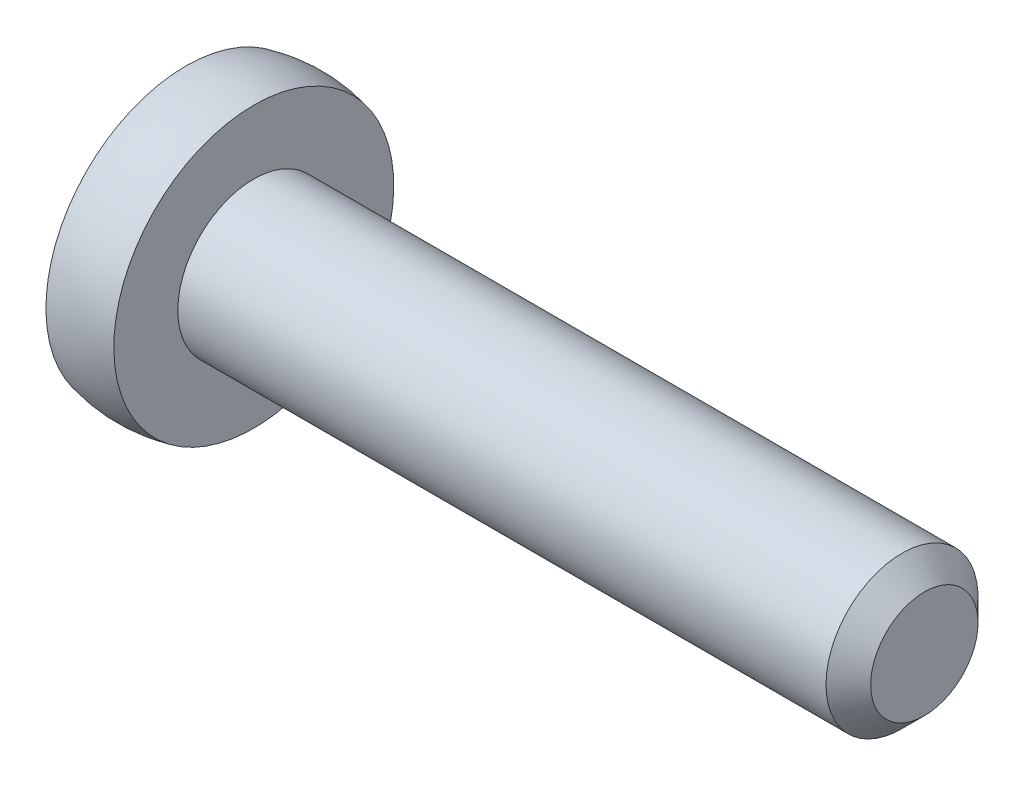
ISO-10303-21;
HEADER;
FILE_DESCRIPTION(('STEP AP214'),'2;1');
FILE_NAME('part.step','',(''),(''),'','','');
FILE_SCHEMA(('AUTOMOTIVE_DESIGN { 1 0 10303 214 1 1 1 1 }'));
ENDSEC;
DATA;
#1=APPLICATION_CONTEXT('core data for automotive mechanical design processes');
#2=APPLICATION_PROTOCOL_DEFINITION('international standard','automotive_design',2000,#1);
#3=PRODUCT_CONTEXT('',#1,'mechanical');
#4=PRODUCT('Part','Part','',(#3));
#5=PRODUCT_RELATED_PRODUCT_CATEGORY('part','',(#4));
#6=PRODUCT_DEFINITION_FORMATION('','',#4);
#7=PRODUCT_DEFINITION_CONTEXT('part definition',#1,'design');
#8=PRODUCT_DEFINITION('design','',#6,#7);
#9=PRODUCT_DEFINITION_SHAPE('','',#8);
#10=(LENGTH_UNIT() NAMED_UNIT(*) SI_UNIT(.MILLI.,.METRE.));
#11=(NAMED_UNIT(*) PLANE_ANGLE_UNIT() SI_UNIT($,.RADIAN.));
#12=(NAMED_UNIT(*) SI_UNIT($,.STERADIAN.) SOLID_ANGLE_UNIT());
#13=UNCERTAINTY_MEASURE_WITH_UNIT(LENGTH_MEASURE(1.E-05),#10,'distance_accuracy_value','');
#14=(GEOMETRIC_REPRESENTATION_CONTEXT(3) GLOBAL_UNCERTAINTY_ASSIGNED_CONTEXT((#13)) GLOBAL_UNIT_ASSIGNED_CONTEXT((#10,
#11,#12)) REPRESENTATION_CONTEXT('',''));
#15=CARTESIAN_POINT('',(0.,0.,0.));
#16=DIRECTION('',(0.,0.,1.));
#17=DIRECTION('',(1.,0.,0.));
#18=AXIS2_PLACEMENT_3D('',#15,#16,#17);
#19=CARTESIAN_POINT('',(2.20574710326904,0.,0.));
#20=DIRECTION('',(1.,0.,0.));
#21=DIRECTION('',(0.,0.,-1.));
#22=AXIS2_PLACEMENT_3D('',#19,#20,#21);
#23=PLANE('',#22);
#24=CARTESIAN_POINT('',(2.20574710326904,0.,0.));
#25=DIRECTION('',(1.,0.,0.));
#26=DIRECTION('',(0.,0.,-1.));
#27=AXIS2_PLACEMENT_3D('',#24,#25,#26);
#28=CIRCLE('',#27,3.97587531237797);
#29=CARTESIAN_POINT('',(2.20574710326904,3.97587531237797,0.));
#30=VERTEX_POINT('',#29);
#31=EDGE_CURVE('E147',#30,#30,#28,.T.);
#32=ORIENTED_EDGE('',*,*,#31,.T.);
#33=EDGE_LOOP('',(#32));
#34=FACE_BOUND('',#33,.T.);
#35=CARTESIAN_POINT('',(2.20574710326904,0.,0.));
#36=DIRECTION('',(1.,0.,0.));
#37=DIRECTION('',(0.,0.,-1.));
#38=AXIS2_PLACEMENT_3D('',#35,#36,#37);
#39=CIRCLE('',#38,2.159);
#40=CARTESIAN_POINT('',(2.20574710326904,0.,2.159));
#41=VERTEX_POINT('',#40);
#42=EDGE_CURVE('E140',#41,#41,#39,.T.);
#43=ORIENTED_EDGE('',*,*,#42,.F.);
#44=EDGE_LOOP('',(#43));
#45=FACE_BOUND('',#44,.T.);
#46=ADVANCED_FACE('F36',(#34,#45),#23,.T.);
#47=CARTESIAN_POINT('',(6.77774710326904,0.,0.));
#48=DIRECTION('',(1.,0.,0.));
#49=DIRECTION('',(0.,1.,0.));
#50=AXIS2_PLACEMENT_3D('',#47,#48,#49);
#51=SPHERICAL_SURFACE('',#50,7.62);
#52=CARTESIAN_POINT('',(0.277222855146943,0.,0.));
#53=DIRECTION('',(1.,0.,0.));
#54=DIRECTION('',(0.,0.,-1.));
#55=AXIS2_PLACEMENT_3D('',#52,#53,#54);
#56=CIRCLE('',#55,3.97587531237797);
#57=CARTESIAN_POINT('',(0.277222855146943,3.97587531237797,0.));
#58=VERTEX_POINT('',#57);
#59=EDGE_CURVE('E143',#58,#58,#56,.T.);
#60=ORIENTED_EDGE('',*,*,#59,.F.);
#61=EDGE_LOOP('',(#60));
#62=FACE_BOUND('',#61,.T.);
#63=CARTESIAN_POINT('',(6.58914186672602,-0.97028982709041,0.));
#64=DIRECTION('',(0.190808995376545,0.981627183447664,0.));
#65=DIRECTION('',(-0.981627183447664,0.190808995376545,0.));
#66=AXIS2_PLACEMENT_3D('',#63,#64,#65);
#67=CIRCLE('',#66,7.55561815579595);
#68=CARTESIAN_POINT('',(-0.813379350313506,0.468614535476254,0.468614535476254));
#69=VERTEX_POINT('',#68);
#70=CARTESIAN_POINT('',(-0.434610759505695,0.394989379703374,2.42698937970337));
#71=VERTEX_POINT('',#70);
#72=EDGE_CURVE('E201',#69,#71,#67,.T.);
#73=ORIENTED_EDGE('',*,*,#72,.T.);
#74=CARTESIAN_POINT('',(6.96974216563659,0.,0.987728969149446));
#75=DIRECTION('',(0.190808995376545,0.,0.981627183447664));
#76=DIRECTION('',(0.981627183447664,0.,-0.190808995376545));
#77=AXIS2_PLACEMENT_3D('',#74,#75,#76);
#78=CIRCLE('',#77,7.55327275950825);
#79=CARTESIAN_POINT('',(-0.434610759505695,-0.394989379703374,2.42698937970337));
#80=VERTEX_POINT('',#79);
#81=EDGE_CURVE('E232',#71,#80,#78,.T.);
#82=ORIENTED_EDGE('',*,*,#81,.T.);
#83=CARTESIAN_POINT('',(6.58914186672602,0.97028982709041,0.));
#84=DIRECTION('',(0.190808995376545,-0.981627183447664,0.));
#85=DIRECTION('',(0.981627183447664,0.190808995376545,0.));
#86=AXIS2_PLACEMENT_3D('',#83,#84,#85);
#87=CIRCLE('',#86,7.55561815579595);
#88=CARTESIAN_POINT('',(-0.813379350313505,-0.468614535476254,0.468614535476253));
#89=VERTEX_POINT('',#88);
#90=EDGE_CURVE('E59',#80,#89,#87,.T.);
#91=ORIENTED_EDGE('',*,*,#90,.T.);
#92=CARTESIAN_POINT('',(6.58914186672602,0.,-0.970289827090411));
#93=DIRECTION('',(0.190808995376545,0.,0.981627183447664));
#94=DIRECTION('',(0.981627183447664,0.,-0.190808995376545));
#95=AXIS2_PLACEMENT_3D('',#92,#93,#94);
#96=CIRCLE('',#95,7.55561815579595);
#97=CARTESIAN_POINT('',(-0.434610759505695,-2.42698937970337,0.394989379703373));
#98=VERTEX_POINT('',#97);
#99=EDGE_CURVE('E228',#89,#98,#96,.T.);
#100=ORIENTED_EDGE('',*,*,#99,.T.);
#101=CARTESIAN_POINT('',(6.96974216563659,-0.987728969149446,0.));
#102=DIRECTION('',(0.190808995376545,-0.981627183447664,0.));
#103=DIRECTION('',(0.981627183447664,0.190808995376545,0.));
#104=AXIS2_PLACEMENT_3D('',#101,#102,#103);
#105=CIRCLE('',#104,7.55327275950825);
#106=CARTESIAN_POINT('',(-0.434610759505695,-2.42698937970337,-0.394989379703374));
#107=VERTEX_POINT('',#106);
#108=EDGE_CURVE('E225',#98,#107,#105,.T.);
#109=ORIENTED_EDGE('',*,*,#108,.T.);
#110=CARTESIAN_POINT('',(6.58914186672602,0.,0.97028982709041));
#111=DIRECTION('',(0.190808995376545,0.,-0.981627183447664));
#112=DIRECTION('',(-0.981627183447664,0.,-0.190808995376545));
#113=AXIS2_PLACEMENT_3D('',#110,#111,#112);
#114=CIRCLE('',#113,7.55561815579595);
#115=CARTESIAN_POINT('',(-0.813379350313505,-0.468614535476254,-0.468614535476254));
#116=VERTEX_POINT('',#115);
#117=EDGE_CURVE('E222',#107,#116,#114,.T.);
#118=ORIENTED_EDGE('',*,*,#117,.T.);
#119=CARTESIAN_POINT('',(6.58914186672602,0.97028982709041,0.));
#120=DIRECTION('',(0.190808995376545,-0.981627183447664,0.));
#121=DIRECTION('',(0.981627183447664,0.190808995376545,0.));
#122=AXIS2_PLACEMENT_3D('',#119,#120,#121);
#123=CIRCLE('',#122,7.55561815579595);
#124=CARTESIAN_POINT('',(-0.434610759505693,-0.394989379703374,-2.42698937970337));
#125=VERTEX_POINT('',#124);
#126=EDGE_CURVE('E219',#116,#125,#123,.T.);
#127=ORIENTED_EDGE('',*,*,#126,.T.);
#128=CARTESIAN_POINT('',(6.96974216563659,0.,-0.987728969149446));
#129=DIRECTION('',(0.190808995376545,0.,-0.981627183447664));
#130=DIRECTION('',(-0.981627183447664,0.,-0.190808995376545));
#131=AXIS2_PLACEMENT_3D('',#128,#129,#130);
#132=CIRCLE('',#131,7.55327275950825);
#133=CARTESIAN_POINT('',(-0.434610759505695,0.394989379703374,-2.42698937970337));
#134=VERTEX_POINT('',#133);
#135=EDGE_CURVE('E216',#125,#134,#132,.T.);
#136=ORIENTED_EDGE('',*,*,#135,.T.);
#137=CARTESIAN_POINT('',(6.58914186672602,-0.97028982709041,0.));
#138=DIRECTION('',(0.190808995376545,0.981627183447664,0.));
#139=DIRECTION('',(-0.981627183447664,0.190808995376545,0.));
#140=AXIS2_PLACEMENT_3D('',#137,#138,#139);
#141=CIRCLE('',#140,7.55561815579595);
#142=CARTESIAN_POINT('',(-0.813379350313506,0.468614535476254,-0.468614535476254));
#143=VERTEX_POINT('',#142);
#144=EDGE_CURVE('E213',#134,#143,#141,.T.);
#145=ORIENTED_EDGE('',*,*,#144,.T.);
#146=CARTESIAN_POINT('',(6.58914186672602,0.,0.97028982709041));
#147=DIRECTION('',(0.190808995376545,0.,-0.981627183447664));
#148=DIRECTION('',(-0.981627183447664,0.,-0.190808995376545));
#149=AXIS2_PLACEMENT_3D('',#146,#147,#148);
#150=CIRCLE('',#149,7.55561815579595);
#151=CARTESIAN_POINT('',(-0.434610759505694,2.42698937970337,-0.394989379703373));
#152=VERTEX_POINT('',#151);
#153=EDGE_CURVE('E210',#143,#152,#150,.T.);
#154=ORIENTED_EDGE('',*,*,#153,.T.);
#155=CARTESIAN_POINT('',(6.96974216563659,0.987728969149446,0.));
#156=DIRECTION('',(0.190808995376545,0.981627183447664,0.));
#157=DIRECTION('',(-0.981627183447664,0.190808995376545,0.));
#158=AXIS2_PLACEMENT_3D('',#155,#156,#157);
#159=CIRCLE('',#158,7.55327275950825);
#160=CARTESIAN_POINT('',(-0.434610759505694,2.42698937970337,0.394989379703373));
#161=VERTEX_POINT('',#160);
#162=EDGE_CURVE('E207',#152,#161,#159,.T.);
#163=ORIENTED_EDGE('',*,*,#162,.T.);
#164=CARTESIAN_POINT('',(6.58914186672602,0.,-0.97028982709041));
#165=DIRECTION('',(0.190808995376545,0.,0.981627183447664));
#166=DIRECTION('',(0.981627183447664,0.,-0.190808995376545));
#167=AXIS2_PLACEMENT_3D('',#164,#165,#166);
#168=CIRCLE('',#167,7.55561815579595);
#169=EDGE_CURVE('E204',#161,#69,#168,.T.);
#170=ORIENTED_EDGE('',*,*,#169,.T.);
#171=EDGE_LOOP('',(#73,#82,#91,#100,#109,#118,#127,#136,#145,#154,#163,#170));
#172=FACE_BOUND('',#171,.T.);
#173=ADVANCED_FACE('F247',(#62,#172),#51,.T.);
#174=CARTESIAN_POINT('',(1.24148497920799,0.,0.));
#175=DIRECTION('',(1.,0.,0.));
#176=DIRECTION('',(0.,1.,0.));
#177=AXIS2_PLACEMENT_3D('',#174,#175,#176);
#178=SPHERICAL_SURFACE('',#177,4.09113504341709);
#179=CARTESIAN_POINT('',(0.277222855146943,3.97587531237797,0.));
#180=CARTESIAN_POINT('',(0.296931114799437,3.98065513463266,0.));
#181=CARTESIAN_POINT('',(0.31667491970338,3.98528839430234,0.));
#182=CARTESIAN_POINT('',(0.356229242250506,3.9942608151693,0.));
#183=CARTESIAN_POINT('',(0.376039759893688,3.99859997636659,0.));
#184=CARTESIAN_POINT('',(0.415723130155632,4.00698322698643,0.));
#185=CARTESIAN_POINT('',(0.435595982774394,4.01102731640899,0.));
#186=CARTESIAN_POINT('',(0.475399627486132,4.01881953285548,0.));
#187=CARTESIAN_POINT('',(0.495330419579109,4.02256765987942,0.));
#188=CARTESIAN_POINT('',(0.535245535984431,4.02976712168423,0.));
#189=CARTESIAN_POINT('',(0.555229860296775,4.0332184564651,0.));
#190=CARTESIAN_POINT('',(0.5952476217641,4.0398235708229,0.));
#191=CARTESIAN_POINT('',(0.615281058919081,4.04297735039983,0.));
#192=CARTESIAN_POINT('',(0.655392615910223,4.04898665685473,0.));
#193=CARTESIAN_POINT('',(0.675470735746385,4.05184218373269,0.));
#194=CARTESIAN_POINT('',(0.715667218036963,4.05725435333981,0.));
#195=CARTESIAN_POINT('',(0.735785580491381,4.05981099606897,0.));
#196=CARTESIAN_POINT('',(0.77605809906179,4.06462483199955,0.));
#197=CARTESIAN_POINT('',(0.796212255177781,4.06688202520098,0.));
#198=CARTESIAN_POINT('',(0.836551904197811,4.07109646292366,0.));
#199=CARTESIAN_POINT('',(0.856737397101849,4.07305370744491,0.));
#200=CARTESIAN_POINT('',(0.897135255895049,4.07666781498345,0.));
#201=CARTESIAN_POINT('',(0.917347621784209,4.07832467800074,0.));
#202=CARTESIAN_POINT('',(0.957794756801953,4.08133765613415,0.));
#203=CARTESIAN_POINT('',(0.978029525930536,4.08269377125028,0.));
#204=CARTESIAN_POINT('',(1.01851699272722,4.08510495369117,0.));
#205=CARTESIAN_POINT('',(1.03876969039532,4.08616002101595,0.));
#206=CARTESIAN_POINT('',(1.07928853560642,4.08796887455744,0.));
#207=CARTESIAN_POINT('',(1.09955468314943,4.08872266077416,0.));
#208=CARTESIAN_POINT('',(1.14009594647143,4.08992878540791,0.));
#209=CARTESIAN_POINT('',(1.16037106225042,4.09038112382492,0.));
#210=CARTESIAN_POINT('',(1.20092577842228,4.09098425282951,0.));
#211=CARTESIAN_POINT('',(1.22120537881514,4.09113504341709,0.));
#212=CARTESIAN_POINT('',(1.26176457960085,4.09113504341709,0.));
#213=CARTESIAN_POINT('',(1.28204417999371,4.09098425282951,0.));
#214=CARTESIAN_POINT('',(1.32259889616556,4.09038112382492,0.));
#215=CARTESIAN_POINT('',(1.34287401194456,4.08992878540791,0.));
#216=CARTESIAN_POINT('',(1.38341527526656,4.08872266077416,0.));
#217=CARTESIAN_POINT('',(1.40368142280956,4.08796887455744,0.));
#218=CARTESIAN_POINT('',(1.44420026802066,4.08616002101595,0.));
#219=CARTESIAN_POINT('',(1.46445296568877,4.08510495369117,0.));
#220=CARTESIAN_POINT('',(1.50494043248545,4.08269377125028,0.));
#221=CARTESIAN_POINT('',(1.52517520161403,4.08133765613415,0.));
#222=CARTESIAN_POINT('',(1.56562233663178,4.07832467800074,0.));
#223=CARTESIAN_POINT('',(1.58583470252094,4.07666781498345,0.));
#224=CARTESIAN_POINT('',(1.62623256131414,4.07305370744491,0.));
#225=CARTESIAN_POINT('',(1.64641805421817,4.07109646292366,0.));
#226=CARTESIAN_POINT('',(1.6867577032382,4.06688202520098,0.));
#227=CARTESIAN_POINT('',(1.70691185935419,4.06462483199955,0.));
#228=CARTESIAN_POINT('',(1.7471843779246,4.05981099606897,0.));
#229=CARTESIAN_POINT('',(1.76730274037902,4.05725435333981,0.));
#230=CARTESIAN_POINT('',(1.8074992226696,4.05184218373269,0.));
#231=CARTESIAN_POINT('',(1.82757734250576,4.04898665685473,0.));
#232=CARTESIAN_POINT('',(1.8676888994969,4.04297735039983,0.));
#233=CARTESIAN_POINT('',(1.88772233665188,4.0398235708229,0.));
#234=CARTESIAN_POINT('',(1.92774009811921,4.0332184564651,0.));
#235=CARTESIAN_POINT('',(1.94772442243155,4.02976712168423,0.));
#236=CARTESIAN_POINT('',(1.98763953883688,4.02256765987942,0.));
#237=CARTESIAN_POINT('',(2.00757033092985,4.01881953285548,0.));
#238=CARTESIAN_POINT('',(2.04737397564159,4.01102731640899,0.));
#239=CARTESIAN_POINT('',(2.06724682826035,4.00698322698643,0.));
#240=CARTESIAN_POINT('',(2.1069301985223,3.99859997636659,0.));
#241=CARTESIAN_POINT('',(2.12674071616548,3.9942608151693,0.));
#242=CARTESIAN_POINT('',(2.1662950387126,3.98528839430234,0.));
#243=CARTESIAN_POINT('',(2.18603884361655,3.98065513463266,0.));
#244=CARTESIAN_POINT('',(2.20574710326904,3.97587531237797,0.));
#245=B_SPLINE_CURVE_WITH_KNOTS('',3,(#179,#180,#181,#182,#183,#184,#185,#186,#187,#188,#189,
#190,#191,#192,#193,#194,#195,#196,#197,#198,#199,#200,#201,#202,#203,#204,#205,#206,#207,#208,
#209,#210,#211,#212,#213,#214,#215,#216,#217,#218,#219,#220,#221,#222,#223,#224,#225,#226,#227,
#228,#229,#230,#231,#232,#233,#234,#235,#236,#237,#238,#239,#240,#241,#242,#243,#244),
.UNSPECIFIED.,.F.,.F.,(4,2,2,2,2,2,2,2,2,2,2,2,2,2,2,2,2,2,2,2,2,2,2,2,2,2,2,2,2,2,2,2,4),(0.,
0.0608382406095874,0.121676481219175,0.182514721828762,0.243352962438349,0.304191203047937,
0.365029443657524,0.425867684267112,0.486705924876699,0.547544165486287,0.608382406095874,
0.669220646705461,0.730058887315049,0.790897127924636,0.851735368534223,0.912573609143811,
0.973411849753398,1.03425009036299,1.09508833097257,1.15592657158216,1.21676481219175,
1.27760305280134,1.33844129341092,1.39927953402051,1.4601177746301,1.52095601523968,
1.58179425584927,1.64263249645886,1.70347073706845,1.76430897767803,1.82514721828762,
1.88598545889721,1.9468236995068),.UNSPECIFIED.);
#246=EDGE_CURVE('BSEAM253',#58,#30,#245,.T.);
#247=ORIENTED_EDGE('',*,*,#59,.T.);
#248=ORIENTED_EDGE('',*,*,#31,.F.);
#249=ORIENTED_EDGE('',*,*,#246,.T.);
#250=ORIENTED_EDGE('',*,*,#246,.F.);
#251=EDGE_LOOP('',(#247,#249,#248,#250));
#252=FACE_BOUND('',#251,.T.);
#253=ADVANCED_FACE('F253',(#252),#178,.T.);
#254=CARTESIAN_POINT('',(-1.016,0.508,2.54));
#255=DIRECTION('',(0.190808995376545,0.,0.981627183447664));
#256=DIRECTION('',(0.981627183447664,0.,-0.190808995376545));
#257=AXIS2_PLACEMENT_3D('',#254,#255,#256);
#258=PLANE('',#257);
#259=DIRECTION('',(-0.964231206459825,0.187427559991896,0.187427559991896));
#260=VECTOR('',#259,1.);
#261=CARTESIAN_POINT('',(-1.016,0.508,2.54));
#262=LINE('',#261,#260);
#263=CARTESIAN_POINT('',(0.889,0.137705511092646,2.16970551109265));
#264=VERTEX_POINT('',#263);
#265=EDGE_CURVE('E51',#264,#71,#262,.T.);
#266=ORIENTED_EDGE('',*,*,#265,.F.);
#267=DIRECTION('',(0.,1.,0.));
#268=VECTOR('',#267,1.);
#269=CARTESIAN_POINT('',(0.889,-0.508,2.16970551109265));
#270=LINE('',#269,#268);
#271=CARTESIAN_POINT('',(0.889,-0.137705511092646,2.16970551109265));
#272=VERTEX_POINT('',#271);
#273=EDGE_CURVE('E131',#264,#272,#270,.F.);
#274=ORIENTED_EDGE('',*,*,#273,.T.);
#275=DIRECTION('',(-0.964231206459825,-0.187427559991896,0.187427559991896));
#276=VECTOR('',#275,1.);
#277=CARTESIAN_POINT('',(-0.648769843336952,-0.436617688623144,2.46861768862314));
#278=LINE('',#277,#276);
#279=EDGE_CURVE('E138',#272,#80,#278,.T.);
#280=ORIENTED_EDGE('',*,*,#279,.T.);
#281=ORIENTED_EDGE('',*,*,#81,.F.);
#282=EDGE_LOOP('',(#266,#274,#280,#281));
#283=FACE_BOUND('',#282,.T.);
#284=ADVANCED_FACE('F137',(#283),#258,.F.);
#285=CARTESIAN_POINT('',(-1.016,-0.508,0.507999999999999));
#286=DIRECTION('',(0.190808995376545,-0.981627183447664,0.));
#287=DIRECTION('',(0.981627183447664,0.190808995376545,0.));
#288=AXIS2_PLACEMENT_3D('',#285,#286,#287);
#289=PLANE('',#288);
#290=ORIENTED_EDGE('',*,*,#279,.F.);
#291=DIRECTION('',(0.,0.,1.));
#292=VECTOR('',#291,1.);
#293=CARTESIAN_POINT('',(0.889,-0.137705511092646,2.54));
#294=LINE('',#293,#292);
#295=CARTESIAN_POINT('',(0.889,-0.137705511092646,0.137705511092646));
#296=VERTEX_POINT('',#295);
#297=EDGE_CURVE('E127',#272,#296,#294,.F.);
#298=ORIENTED_EDGE('',*,*,#297,.T.);
#299=DIRECTION('',(-0.964231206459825,-0.187427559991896,0.187427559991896));
#300=VECTOR('',#299,1.);
#301=CARTESIAN_POINT('',(-1.016,-0.508,0.507999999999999));
#302=LINE('',#301,#300);
#303=EDGE_CURVE('E144',#296,#89,#302,.T.);
#304=ORIENTED_EDGE('',*,*,#303,.T.);
#305=ORIENTED_EDGE('',*,*,#90,.F.);
#306=EDGE_LOOP('',(#290,#298,#304,#305));
#307=FACE_BOUND('',#306,.T.);
#308=ADVANCED_FACE('F142',(#307),#289,.F.);
#309=CARTESIAN_POINT('',(-1.016,-2.54,0.507999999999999));
#310=DIRECTION('',(0.190808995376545,0.,0.981627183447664));
#311=DIRECTION('',(0.981627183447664,0.,-0.190808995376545));
#312=AXIS2_PLACEMENT_3D('',#309,#310,#311);
#313=PLANE('',#312);
#314=ORIENTED_EDGE('',*,*,#303,.F.);
#315=DIRECTION('',(0.,1.,0.));
#316=VECTOR('',#315,1.);
#317=CARTESIAN_POINT('',(0.889,-0.508,0.137705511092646));
#318=LINE('',#317,#316);
#319=CARTESIAN_POINT('',(0.889,-2.16970551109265,0.137705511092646));
#320=VERTEX_POINT('',#319);
#321=EDGE_CURVE('E133',#296,#320,#318,.F.);
#322=ORIENTED_EDGE('',*,*,#321,.T.);
#323=DIRECTION('',(-0.964231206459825,-0.187427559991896,0.187427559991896));
#324=VECTOR('',#323,1.);
#325=CARTESIAN_POINT('',(-1.016,-2.54,0.507999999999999));
#326=LINE('',#325,#324);
#327=EDGE_CURVE('E149',#320,#98,#326,.T.);
#328=ORIENTED_EDGE('',*,*,#327,.T.);
#329=ORIENTED_EDGE('',*,*,#99,.F.);
#330=EDGE_LOOP('',(#314,#322,#328,#329));
#331=FACE_BOUND('',#330,.T.);
#332=ADVANCED_FACE('F302',(#331),#313,.F.);
#333=CARTESIAN_POINT('',(-1.016,-2.54,0.507999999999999));
#334=DIRECTION('',(0.190808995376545,-0.981627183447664,0.));
#335=DIRECTION('',(0.981627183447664,0.190808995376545,0.));
#336=AXIS2_PLACEMENT_3D('',#333,#334,#335);
#337=PLANE('',#336);
#338=ORIENTED_EDGE('',*,*,#327,.F.);
#339=DIRECTION('',(0.,0.,1.));
#340=VECTOR('',#339,1.);
#341=CARTESIAN_POINT('',(0.889,-2.16970551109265,2.54));
#342=LINE('',#341,#340);
#343=CARTESIAN_POINT('',(0.889,-2.16970551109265,-0.137705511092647));
#344=VERTEX_POINT('',#343);
#345=EDGE_CURVE('E182',#320,#344,#342,.F.);
#346=ORIENTED_EDGE('',*,*,#345,.T.);
#347=DIRECTION('',(-0.964231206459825,-0.187427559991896,-0.187427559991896));
#348=VECTOR('',#347,1.);
#349=CARTESIAN_POINT('',(-0.648769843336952,-2.46861768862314,-0.436617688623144));
#350=LINE('',#349,#348);
#351=EDGE_CURVE('E176',#344,#107,#350,.T.);
#352=ORIENTED_EDGE('',*,*,#351,.T.);
#353=ORIENTED_EDGE('',*,*,#108,.F.);
#354=EDGE_LOOP('',(#338,#346,#352,#353));
#355=FACE_BOUND('',#354,.T.);
#356=ADVANCED_FACE('F300',(#355),#337,.F.);
#357=CARTESIAN_POINT('',(-1.016,-0.508,-0.508));
#358=DIRECTION('',(0.190808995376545,0.,-0.981627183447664));
#359=DIRECTION('',(-0.981627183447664,0.,-0.190808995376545));
#360=AXIS2_PLACEMENT_3D('',#357,#358,#359);
#361=PLANE('',#360);
#362=ORIENTED_EDGE('',*,*,#351,.F.);
#363=DIRECTION('',(0.,-1.,0.));
#364=VECTOR('',#363,1.);
#365=CARTESIAN_POINT('',(0.889,-0.508,-0.137705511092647));
#366=LINE('',#365,#364);
#367=CARTESIAN_POINT('',(0.889,-0.137705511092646,-0.137705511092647));
#368=VERTEX_POINT('',#367);
#369=EDGE_CURVE('E184',#344,#368,#366,.F.);
#370=ORIENTED_EDGE('',*,*,#369,.T.);
#371=DIRECTION('',(-0.964231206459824,-0.187427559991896,-0.187427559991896));
#372=VECTOR('',#371,1.);
#373=CARTESIAN_POINT('',(-1.016,-0.508,-0.508));
#374=LINE('',#373,#372);
#375=EDGE_CURVE('E173',#368,#116,#374,.T.);
#376=ORIENTED_EDGE('',*,*,#375,.T.);
#377=ORIENTED_EDGE('',*,*,#117,.F.);
#378=EDGE_LOOP('',(#362,#370,#376,#377));
#379=FACE_BOUND('',#378,.T.);
#380=ADVANCED_FACE('F297',(#379),#361,.F.);
#381=CARTESIAN_POINT('',(-1.016,-0.508,-2.54));
#382=DIRECTION('',(0.190808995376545,-0.981627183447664,0.));
#383=DIRECTION('',(0.981627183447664,0.190808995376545,0.));
#384=AXIS2_PLACEMENT_3D('',#381,#382,#383);
#385=PLANE('',#384);
#386=ORIENTED_EDGE('',*,*,#375,.F.);
#387=DIRECTION('',(0.,0.,1.));
#388=VECTOR('',#387,1.);
#389=CARTESIAN_POINT('',(0.889,-0.137705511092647,2.54));
#390=LINE('',#389,#388);
#391=CARTESIAN_POINT('',(0.889,-0.137705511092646,-2.16970551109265));
#392=VERTEX_POINT('',#391);
#393=EDGE_CURVE('E186',#368,#392,#390,.F.);
#394=ORIENTED_EDGE('',*,*,#393,.T.);
#395=DIRECTION('',(-0.964231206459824,-0.187427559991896,-0.187427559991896));
#396=VECTOR('',#395,1.);
#397=CARTESIAN_POINT('',(-0.832384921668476,-0.472308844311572,-2.50430884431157));
#398=LINE('',#397,#396);
#399=EDGE_CURVE('E170',#392,#125,#398,.T.);
#400=ORIENTED_EDGE('',*,*,#399,.T.);
#401=ORIENTED_EDGE('',*,*,#126,.F.);
#402=EDGE_LOOP('',(#386,#394,#400,#401));
#403=FACE_BOUND('',#402,.T.);
#404=ADVANCED_FACE('F294',(#403),#385,.F.);
#405=CARTESIAN_POINT('',(-1.016,0.508,-2.54));
#406=DIRECTION('',(0.190808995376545,0.,-0.981627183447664));
#407=DIRECTION('',(-0.981627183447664,0.,-0.190808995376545));
#408=AXIS2_PLACEMENT_3D('',#405,#406,#407);
#409=PLANE('',#408);
#410=ORIENTED_EDGE('',*,*,#399,.F.);
#411=DIRECTION('',(0.,-1.,0.));
#412=VECTOR('',#411,1.);
#413=CARTESIAN_POINT('',(0.889,-0.508,-2.16970551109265));
#414=LINE('',#413,#412);
#415=CARTESIAN_POINT('',(0.889,0.137705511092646,-2.16970551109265));
#416=VERTEX_POINT('',#415);
#417=EDGE_CURVE('E188',#392,#416,#414,.F.);
#418=ORIENTED_EDGE('',*,*,#417,.T.);
#419=DIRECTION('',(-0.964231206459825,0.187427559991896,-0.187427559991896));
#420=VECTOR('',#419,1.);
#421=CARTESIAN_POINT('',(-0.648769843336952,0.436617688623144,-2.46861768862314));
#422=LINE('',#421,#420);
#423=EDGE_CURVE('E167',#416,#134,#422,.T.);
#424=ORIENTED_EDGE('',*,*,#423,.T.);
#425=ORIENTED_EDGE('',*,*,#135,.F.);
#426=EDGE_LOOP('',(#410,#418,#424,#425));
#427=FACE_BOUND('',#426,.T.);
#428=ADVANCED_FACE('F288',(#427),#409,.F.);
#429=CARTESIAN_POINT('',(-1.016,0.508,-0.508));
#430=DIRECTION('',(0.190808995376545,0.981627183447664,0.));
#431=DIRECTION('',(-0.981627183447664,0.190808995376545,0.));
#432=AXIS2_PLACEMENT_3D('',#429,#430,#431);
#433=PLANE('',#432);
#434=ORIENTED_EDGE('',*,*,#423,.F.);
#435=DIRECTION('',(0.,0.,-1.));
#436=VECTOR('',#435,1.);
#437=CARTESIAN_POINT('',(0.889,0.137705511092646,2.54));
#438=LINE('',#437,#436);
#439=CARTESIAN_POINT('',(0.889,0.137705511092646,-0.137705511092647));
#440=VERTEX_POINT('',#439);
#441=EDGE_CURVE('E190',#416,#440,#438,.F.);
#442=ORIENTED_EDGE('',*,*,#441,.T.);
#443=DIRECTION('',(-0.964231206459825,0.187427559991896,-0.187427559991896));
#444=VECTOR('',#443,1.);
#445=CARTESIAN_POINT('',(-1.016,0.508,-0.508));
#446=LINE('',#445,#444);
#447=EDGE_CURVE('E164',#440,#143,#446,.T.);
#448=ORIENTED_EDGE('',*,*,#447,.T.);
#449=ORIENTED_EDGE('',*,*,#144,.F.);
#450=EDGE_LOOP('',(#434,#442,#448,#449));
#451=FACE_BOUND('',#450,.T.);
#452=ADVANCED_FACE('F285',(#451),#433,.F.);
#453=CARTESIAN_POINT('',(-1.016,2.54,-0.508));
#454=DIRECTION('',(0.190808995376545,0.,-0.981627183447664));
#455=DIRECTION('',(-0.981627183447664,0.,-0.190808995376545));
#456=AXIS2_PLACEMENT_3D('',#453,#454,#455);
#457=PLANE('',#456);
#458=ORIENTED_EDGE('',*,*,#447,.F.);
#459=DIRECTION('',(0.,-1.,0.));
#460=VECTOR('',#459,1.);
#461=CARTESIAN_POINT('',(0.889,-0.507999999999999,-0.137705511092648));
#462=LINE('',#461,#460);
#463=CARTESIAN_POINT('',(0.889,2.16970551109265,-0.137705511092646));
#464=VERTEX_POINT('',#463);
#465=EDGE_CURVE('E192',#440,#464,#462,.F.);
#466=ORIENTED_EDGE('',*,*,#465,.T.);
#467=DIRECTION('',(-0.964231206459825,0.187427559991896,-0.187427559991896));
#468=VECTOR('',#467,1.);
#469=CARTESIAN_POINT('',(-0.832384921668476,2.50430884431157,-0.472308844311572));
#470=LINE('',#469,#468);
#471=EDGE_CURVE('E161',#464,#152,#470,.T.);
#472=ORIENTED_EDGE('',*,*,#471,.T.);
#473=ORIENTED_EDGE('',*,*,#153,.F.);
#474=EDGE_LOOP('',(#458,#466,#472,#473));
#475=FACE_BOUND('',#474,.T.);
#476=ADVANCED_FACE('F282',(#475),#457,.F.);
#477=CARTESIAN_POINT('',(-1.016,2.54,0.508));
#478=DIRECTION('',(0.190808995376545,0.981627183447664,0.));
#479=DIRECTION('',(-0.981627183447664,0.190808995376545,0.));
#480=AXIS2_PLACEMENT_3D('',#477,#478,#479);
#481=PLANE('',#480);
#482=ORIENTED_EDGE('',*,*,#471,.F.);
#483=DIRECTION('',(0.,0.,-1.));
#484=VECTOR('',#483,1.);
#485=CARTESIAN_POINT('',(0.889,2.16970551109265,2.54));
#486=LINE('',#485,#484);
#487=CARTESIAN_POINT('',(0.889,2.16970551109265,0.137705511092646));
#488=VERTEX_POINT('',#487);
#489=EDGE_CURVE('E194',#464,#488,#486,.F.);
#490=ORIENTED_EDGE('',*,*,#489,.T.);
#491=DIRECTION('',(-0.964231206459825,0.187427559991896,0.187427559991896));
#492=VECTOR('',#491,1.);
#493=CARTESIAN_POINT('',(-0.648769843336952,2.46861768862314,0.436617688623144));
#494=LINE('',#493,#492);
#495=EDGE_CURVE('E158',#488,#161,#494,.T.);
#496=ORIENTED_EDGE('',*,*,#495,.T.);
#497=ORIENTED_EDGE('',*,*,#162,.F.);
#498=EDGE_LOOP('',(#482,#490,#496,#497));
#499=FACE_BOUND('',#498,.T.);
#500=ADVANCED_FACE('F279',(#499),#481,.F.);
#501=CARTESIAN_POINT('',(-1.016,0.508,0.508));
#502=DIRECTION('',(0.190808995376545,0.,0.981627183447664));
#503=DIRECTION('',(0.981627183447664,0.,-0.190808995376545));
#504=AXIS2_PLACEMENT_3D('',#501,#502,#503);
#505=PLANE('',#504);
#506=ORIENTED_EDGE('',*,*,#495,.F.);
#507=DIRECTION('',(0.,1.,0.));
#508=VECTOR('',#507,1.);
#509=CARTESIAN_POINT('',(0.889,-0.508,0.137705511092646));
#510=LINE('',#509,#508);
#511=CARTESIAN_POINT('',(0.889,0.137705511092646,0.137705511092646));
#512=VERTEX_POINT('',#511);
#513=EDGE_CURVE('E196',#488,#512,#510,.F.);
#514=ORIENTED_EDGE('',*,*,#513,.T.);
#515=DIRECTION('',(-0.964231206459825,0.187427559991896,0.187427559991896));
#516=VECTOR('',#515,1.);
#517=CARTESIAN_POINT('',(-1.016,0.508,0.508));
#518=LINE('',#517,#516);
#519=EDGE_CURVE('E154',#512,#69,#518,.T.);
#520=ORIENTED_EDGE('',*,*,#519,.T.);
#521=ORIENTED_EDGE('',*,*,#169,.F.);
#522=EDGE_LOOP('',(#506,#514,#520,#521));
#523=FACE_BOUND('',#522,.T.);
#524=ADVANCED_FACE('F272',(#523),#505,.F.);
#525=CARTESIAN_POINT('',(-1.016,0.508,2.54));
#526=DIRECTION('',(0.190808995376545,0.981627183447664,0.));
#527=DIRECTION('',(-0.981627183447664,0.190808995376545,0.));
#528=AXIS2_PLACEMENT_3D('',#525,#526,#527);
#529=PLANE('',#528);
#530=ORIENTED_EDGE('',*,*,#519,.F.);
#531=DIRECTION('',(0.,0.,-1.));
#532=VECTOR('',#531,1.);
#533=CARTESIAN_POINT('',(0.889,0.137705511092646,2.54));
#534=LINE('',#533,#532);
#535=EDGE_CURVE('E155',#512,#264,#534,.F.);
#536=ORIENTED_EDGE('',*,*,#535,.T.);
#537=ORIENTED_EDGE('',*,*,#265,.T.);
#538=ORIENTED_EDGE('',*,*,#72,.F.);
#539=EDGE_LOOP('',(#530,#536,#537,#538));
#540=FACE_BOUND('',#539,.T.);
#541=ADVANCED_FACE('F269',(#540),#529,.F.);
#542=CARTESIAN_POINT('',(0.889,-0.508,2.54));
#543=DIRECTION('',(-1.,0.,0.));
#544=DIRECTION('',(0.,0.,1.));
#545=AXIS2_PLACEMENT_3D('',#542,#543,#544);
#546=PLANE('',#545);
#547=ORIENTED_EDGE('',*,*,#273,.F.);
#548=ORIENTED_EDGE('',*,*,#535,.F.);
#549=ORIENTED_EDGE('',*,*,#513,.F.);
#550=ORIENTED_EDGE('',*,*,#489,.F.);
#551=ORIENTED_EDGE('',*,*,#465,.F.);
#552=ORIENTED_EDGE('',*,*,#441,.F.);
#553=ORIENTED_EDGE('',*,*,#417,.F.);
#554=ORIENTED_EDGE('',*,*,#393,.F.);
#555=ORIENTED_EDGE('',*,*,#369,.F.);
#556=ORIENTED_EDGE('',*,*,#345,.F.);
#557=ORIENTED_EDGE('',*,*,#321,.F.);
#558=ORIENTED_EDGE('',*,*,#297,.F.);
#559=EDGE_LOOP('',(#547,#548,#549,#550,#551,#552,#553,#554,#555,#556,#557,#558));
#560=FACE_BOUND('',#559,.T.);
#561=ADVANCED_FACE('F129',(#560),#546,.T.);
#562=CARTESIAN_POINT('',(21.255747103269,0.,0.));
#563=DIRECTION('',(-1.,0.,0.));
#564=DIRECTION('',(0.,0.,1.));
#565=AXIS2_PLACEMENT_3D('',#562,#563,#564);
#566=CYLINDRICAL_SURFACE('',#565,2.159);
#567=CARTESIAN_POINT('',(20.6207471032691,0.,0.));
#568=DIRECTION('',(1.,0.,0.));
#569=DIRECTION('',(0.,0.,-1.));
#570=AXIS2_PLACEMENT_3D('',#567,#568,#569);
#571=CIRCLE('',#570,2.159);
#572=CARTESIAN_POINT('',(20.620747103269,0.,2.159));
#573=VERTEX_POINT('',#572);
#574=EDGE_CURVE('E11',#573,#573,#571,.F.);
#575=CARTESIAN_POINT('',(20.620747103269,0.,2.159));
#576=CARTESIAN_POINT('',(20.4289241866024,0.,2.159));
#577=CARTESIAN_POINT('',(20.2371012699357,0.,2.159));
#578=CARTESIAN_POINT('',(19.8534554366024,0.,2.159));
#579=CARTESIAN_POINT('',(19.6616325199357,0.,2.159));
#580=CARTESIAN_POINT('',(19.2779866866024,0.,2.159));
#581=CARTESIAN_POINT('',(19.0861637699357,0.,2.159));
#582=CARTESIAN_POINT('',(18.7025179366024,0.,2.159));
#583=CARTESIAN_POINT('',(18.5106950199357,0.,2.159));
#584=CARTESIAN_POINT('',(18.1270491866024,0.,2.159));
#585=CARTESIAN_POINT('',(17.9352262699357,0.,2.159));
#586=CARTESIAN_POINT('',(17.5515804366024,0.,2.159));
#587=CARTESIAN_POINT('',(17.3597575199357,0.,2.159));
#588=CARTESIAN_POINT('',(16.9761116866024,0.,2.159));
#589=CARTESIAN_POINT('',(16.7842887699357,0.,2.159));
#590=CARTESIAN_POINT('',(16.4006429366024,0.,2.159));
#591=CARTESIAN_POINT('',(16.2088200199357,0.,2.159));
#592=CARTESIAN_POINT('',(15.8251741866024,0.,2.159));
#593=CARTESIAN_POINT('',(15.6333512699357,0.,2.159));
#594=CARTESIAN_POINT('',(15.2497054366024,0.,2.159));
#595=CARTESIAN_POINT('',(15.0578825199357,0.,2.159));
#596=CARTESIAN_POINT('',(14.6742366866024,0.,2.159));
#597=CARTESIAN_POINT('',(14.4824137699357,0.,2.159));
#598=CARTESIAN_POINT('',(14.0987679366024,0.,2.159));
#599=CARTESIAN_POINT('',(13.9069450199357,0.,2.159));
#600=CARTESIAN_POINT('',(13.5232991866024,0.,2.159));
#601=CARTESIAN_POINT('',(13.3314762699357,0.,2.159));
#602=CARTESIAN_POINT('',(12.9478304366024,0.,2.159));
#603=CARTESIAN_POINT('',(12.7560075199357,0.,2.159));
#604=CARTESIAN_POINT('',(12.3723616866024,0.,2.159));
#605=CARTESIAN_POINT('',(12.1805387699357,0.,2.159));
#606=CARTESIAN_POINT('',(11.7968929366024,0.,2.159));
#607=CARTESIAN_POINT('',(11.6050700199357,0.,2.159));
#608=CARTESIAN_POINT('',(11.2214241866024,0.,2.159));
#609=CARTESIAN_POINT('',(11.0296012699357,0.,2.159));
#610=CARTESIAN_POINT('',(10.6459554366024,0.,2.159));
#611=CARTESIAN_POINT('',(10.4541325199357,0.,2.159));
#612=CARTESIAN_POINT('',(10.0704866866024,0.,2.159));
#613=CARTESIAN_POINT('',(9.87866376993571,0.,2.159));
#614=CARTESIAN_POINT('',(9.49501793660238,0.,2.159));
#615=CARTESIAN_POINT('',(9.30319501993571,0.,2.159));
#616=CARTESIAN_POINT('',(8.91954918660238,0.,2.159));
#617=CARTESIAN_POINT('',(8.72772626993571,0.,2.159));
#618=CARTESIAN_POINT('',(8.34408043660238,0.,2.159));
#619=CARTESIAN_POINT('',(8.15225751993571,0.,2.159));
#620=CARTESIAN_POINT('',(7.76861168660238,0.,2.159));
#621=CARTESIAN_POINT('',(7.57678876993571,0.,2.159));
#622=CARTESIAN_POINT('',(7.19314293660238,0.,2.159));
#623=CARTESIAN_POINT('',(7.00132001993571,0.,2.159));
#624=CARTESIAN_POINT('',(6.61767418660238,0.,2.159));
#625=CARTESIAN_POINT('',(6.42585126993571,0.,2.159));
#626=CARTESIAN_POINT('',(6.04220543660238,0.,2.159));
#627=CARTESIAN_POINT('',(5.85038251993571,0.,2.159));
#628=CARTESIAN_POINT('',(5.46673668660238,0.,2.159));
#629=CARTESIAN_POINT('',(5.27491376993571,0.,2.159));
#630=CARTESIAN_POINT('',(4.89126793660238,0.,2.159));
#631=CARTESIAN_POINT('',(4.69944501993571,0.,2.159));
#632=CARTESIAN_POINT('',(4.31579918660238,0.,2.159));
#633=CARTESIAN_POINT('',(4.12397626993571,0.,2.159));
#634=CARTESIAN_POINT('',(3.74033043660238,0.,2.159));
#635=CARTESIAN_POINT('',(3.54850751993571,0.,2.159));
#636=CARTESIAN_POINT('',(3.16486168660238,0.,2.159));
#637=CARTESIAN_POINT('',(2.97303876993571,0.,2.159));
#638=CARTESIAN_POINT('',(2.58939293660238,0.,2.159));
#639=CARTESIAN_POINT('',(2.39757001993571,0.,2.159));
#640=CARTESIAN_POINT('',(2.20574710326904,0.,2.159));
#641=B_SPLINE_CURVE_WITH_KNOTS('',3,(#575,#576,#577,#578,#579,#580,#581,#582,#583,#584,#585,
#586,#587,#588,#589,#590,#591,#592,#593,#594,#595,#596,#597,#598,#599,#600,#601,#602,#603,#604,
#605,#606,#607,#608,#609,#610,#611,#612,#613,#614,#615,#616,#617,#618,#619,#620,#621,#622,#623,
#624,#625,#626,#627,#628,#629,#630,#631,#632,#633,#634,#635,#636,#637,#638,#639,#640),
.UNSPECIFIED.,.F.,.F.,(4,2,2,2,2,2,2,2,2,2,2,2,2,2,2,2,2,2,2,2,2,2,2,2,2,2,2,2,2,2,2,2,4),(0.,
0.575468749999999,1.1509375,1.72640625,2.301875,2.87734375,3.4528125,4.02828125,4.60375,
5.17921875,5.7546875,6.33015625,6.905625,7.48109375,8.0565625,8.63203125,9.2075,9.78296875,
10.3584375,10.93390625,11.509375,12.08484375,12.6603125,13.23578125,13.81125,14.38671875,
14.9621875,15.53765625,16.113125,16.68859375,17.2640625,17.83953125,18.415),.UNSPECIFIED.);
#642=EDGE_CURVE('BSEAM243',#573,#41,#641,.T.);
#643=ORIENTED_EDGE('',*,*,#574,.T.);
#644=ORIENTED_EDGE('',*,*,#42,.T.);
#645=ORIENTED_EDGE('',*,*,#642,.T.);
#646=ORIENTED_EDGE('',*,*,#642,.F.);
#647=EDGE_LOOP('',(#643,#645,#644,#646));
#648=FACE_BOUND('',#647,.T.);
#649=ADVANCED_FACE('F243',(#648),#566,.T.);
#650=CARTESIAN_POINT('',(21.255747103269,0.,0.));
#651=DIRECTION('',(1.,0.,0.));
#652=DIRECTION('',(0.,0.,-1.));
#653=AXIS2_PLACEMENT_3D('',#650,#651,#652);
#654=PLANE('',#653);
#655=CARTESIAN_POINT('',(21.255747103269,0.,0.));
#656=DIRECTION('',(1.,0.,0.));
#657=DIRECTION('',(0.,0.,-1.));
#658=AXIS2_PLACEMENT_3D('',#655,#656,#657);
#659=CIRCLE('',#658,1.52400000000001);
#660=CARTESIAN_POINT('',(21.255747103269,0.,-1.52400000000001));
#661=VERTEX_POINT('',#660);
#662=EDGE_CURVE('E44',#661,#661,#659,.T.);
#663=ORIENTED_EDGE('',*,*,#662,.T.);
#664=EDGE_LOOP('',(#663));
#665=FACE_BOUND('',#664,.T.);
#666=ADVANCED_FACE('F236',(#665),#654,.T.);
#667=CARTESIAN_POINT('',(21.255747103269,0.,0.));
#668=DIRECTION('',(-1.,0.,0.));
#669=DIRECTION('',(0.,0.,1.));
#670=AXIS2_PLACEMENT_3D('',#667,#668,#669);
#671=CONICAL_SURFACE('',#670,1.52400000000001,0.785398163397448);
#672=ORIENTED_EDGE('',*,*,#574,.F.);
#673=EDGE_LOOP('',(#672));
#674=FACE_BOUND('',#673,.T.);
#675=ORIENTED_EDGE('',*,*,#662,.F.);
#676=EDGE_LOOP('',(#675));
#677=FACE_BOUND('',#676,.T.);
#678=ADVANCED_FACE('F38',(#674,#677),#671,.T.);
#679=CLOSED_SHELL('',(#46,#173,#253,#284,#308,#332,#356,#380,#404,#428,#452,#476,#500,#524,#541,
#561,#649,#666,#678));
#680=MANIFOLD_SOLID_BREP('B2',#679);
#681=ADVANCED_BREP_SHAPE_REPRESENTATION('',(#18,#680),#14);
#682=SHAPE_DEFINITION_REPRESENTATION(#9,#681);
ENDSEC;
END-ISO-10303-21;
